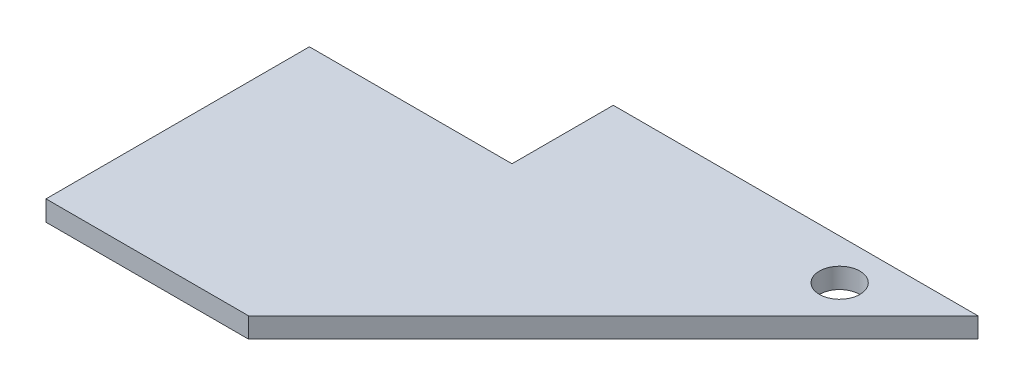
ISO-10303-21;
HEADER;
FILE_DESCRIPTION(('STEP AP214'),'2;1');
FILE_NAME('part.step','',(''),(''),'','','');
FILE_SCHEMA(('AUTOMOTIVE_DESIGN { 1 0 10303 214 1 1 1 1 }'));
ENDSEC;
DATA;
#1=APPLICATION_CONTEXT('core data for automotive mechanical design processes');
#2=APPLICATION_PROTOCOL_DEFINITION('international standard','automotive_design',2000,#1);
#3=PRODUCT_CONTEXT('',#1,'mechanical');
#4=PRODUCT('Part','Part','',(#3));
#5=PRODUCT_RELATED_PRODUCT_CATEGORY('part','',(#4));
#6=PRODUCT_DEFINITION_FORMATION('','',#4);
#7=PRODUCT_DEFINITION_CONTEXT('part definition',#1,'design');
#8=PRODUCT_DEFINITION('design','',#6,#7);
#9=PRODUCT_DEFINITION_SHAPE('','',#8);
#10=(LENGTH_UNIT() NAMED_UNIT(*) SI_UNIT(.MILLI.,.METRE.));
#11=(NAMED_UNIT(*) PLANE_ANGLE_UNIT() SI_UNIT($,.RADIAN.));
#12=(NAMED_UNIT(*) SI_UNIT($,.STERADIAN.) SOLID_ANGLE_UNIT());
#13=UNCERTAINTY_MEASURE_WITH_UNIT(LENGTH_MEASURE(1.E-05),#10,'distance_accuracy_value','');
#14=(GEOMETRIC_REPRESENTATION_CONTEXT(3) GLOBAL_UNCERTAINTY_ASSIGNED_CONTEXT((#13)) GLOBAL_UNIT_ASSIGNED_CONTEXT((#10,
#11,#12)) REPRESENTATION_CONTEXT('',''));
#15=CARTESIAN_POINT('',(0.,0.,0.));
#16=DIRECTION('',(0.,0.,1.));
#17=DIRECTION('',(1.,0.,0.));
#18=AXIS2_PLACEMENT_3D('',#15,#16,#17);
#19=CARTESIAN_POINT('',(0.,5.,-65.));
#20=DIRECTION('',(1.,0.,0.));
#21=DIRECTION('',(0.,0.,-1.));
#22=AXIS2_PLACEMENT_3D('',#19,#20,#21);
#23=PLANE('',#22);
#24=DIRECTION('',(0.,0.,1.));
#25=VECTOR('',#24,1.);
#26=CARTESIAN_POINT('',(0.,0.,-65.));
#27=LINE('',#26,#25);
#28=CARTESIAN_POINT('',(0.,0.,-65.));
#29=VERTEX_POINT('',#28);
#30=CARTESIAN_POINT('',(0.,0.,0.));
#31=VERTEX_POINT('',#30);
#32=EDGE_CURVE('E89',#29,#31,#27,.T.);
#33=ORIENTED_EDGE('',*,*,#32,.T.);
#34=DIRECTION('',(0.,-1.,0.));
#35=VECTOR('',#34,1.);
#36=CARTESIAN_POINT('',(0.,5.,0.));
#37=LINE('',#36,#35);
#38=CARTESIAN_POINT('',(0.,5.,0.));
#39=VERTEX_POINT('',#38);
#40=EDGE_CURVE('E11',#39,#31,#37,.T.);
#41=ORIENTED_EDGE('',*,*,#40,.F.);
#42=DIRECTION('',(0.,0.,1.));
#43=VECTOR('',#42,1.);
#44=CARTESIAN_POINT('',(0.,5.,-65.));
#45=LINE('',#44,#43);
#46=CARTESIAN_POINT('',(0.,5.,-65.));
#47=VERTEX_POINT('',#46);
#48=EDGE_CURVE('E117',#47,#39,#45,.T.);
#49=ORIENTED_EDGE('',*,*,#48,.F.);
#50=DIRECTION('',(0.,-1.,0.));
#51=VECTOR('',#50,1.);
#52=CARTESIAN_POINT('',(0.,5.,-65.));
#53=LINE('',#52,#51);
#54=EDGE_CURVE('E102',#47,#29,#53,.T.);
#55=ORIENTED_EDGE('',*,*,#54,.T.);
#56=EDGE_LOOP('',(#33,#41,#49,#55));
#57=FACE_BOUND('',#56,.T.);
#58=ADVANCED_FACE('F33',(#57),#23,.F.);
#59=CARTESIAN_POINT('',(0.,5.,0.));
#60=DIRECTION('',(0.,0.,-1.));
#61=DIRECTION('',(-1.,0.,0.));
#62=AXIS2_PLACEMENT_3D('',#59,#60,#61);
#63=PLANE('',#62);
#64=DIRECTION('',(1.,0.,0.));
#65=VECTOR('',#64,1.);
#66=CARTESIAN_POINT('',(0.,0.,0.));
#67=LINE('',#66,#65);
#68=CARTESIAN_POINT('',(50.,0.,0.));
#69=VERTEX_POINT('',#68);
#70=EDGE_CURVE('E85',#31,#69,#67,.T.);
#71=ORIENTED_EDGE('',*,*,#70,.T.);
#72=DIRECTION('',(0.,-1.,0.));
#73=VECTOR('',#72,1.);
#74=CARTESIAN_POINT('',(50.,5.,0.));
#75=LINE('',#74,#73);
#76=CARTESIAN_POINT('',(50.,5.,0.));
#77=VERTEX_POINT('',#76);
#78=EDGE_CURVE('E40',#77,#69,#75,.T.);
#79=ORIENTED_EDGE('',*,*,#78,.F.);
#80=DIRECTION('',(1.,0.,0.));
#81=VECTOR('',#80,1.);
#82=CARTESIAN_POINT('',(0.,5.,0.));
#83=LINE('',#82,#81);
#84=EDGE_CURVE('E98',#39,#77,#83,.T.);
#85=ORIENTED_EDGE('',*,*,#84,.F.);
#86=ORIENTED_EDGE('',*,*,#40,.T.);
#87=EDGE_LOOP('',(#71,#79,#85,#86));
#88=FACE_BOUND('',#87,.T.);
#89=ADVANCED_FACE('F97',(#88),#63,.F.);
#90=CARTESIAN_POINT('',(50.,5.,0.));
#91=DIRECTION('',(-0.707106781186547,0.,-0.707106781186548));
#92=DIRECTION('',(-0.707106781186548,0.,0.707106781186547));
#93=AXIS2_PLACEMENT_3D('',#90,#91,#92);
#94=PLANE('',#93);
#95=DIRECTION('',(0.707106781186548,0.,-0.707106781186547));
#96=VECTOR('',#95,1.);
#97=CARTESIAN_POINT('',(50.,0.,0.));
#98=LINE('',#97,#96);
#99=CARTESIAN_POINT('',(140.,0.,-89.9999999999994));
#100=VERTEX_POINT('',#99);
#101=EDGE_CURVE('E91',#69,#100,#98,.T.);
#102=ORIENTED_EDGE('',*,*,#101,.T.);
#103=DIRECTION('',(0.,-1.,0.));
#104=VECTOR('',#103,1.);
#105=CARTESIAN_POINT('',(140.,5.,-89.9999999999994));
#106=LINE('',#105,#104);
#107=CARTESIAN_POINT('',(140.,5.,-89.9999999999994));
#108=VERTEX_POINT('',#107);
#109=EDGE_CURVE('E133',#108,#100,#106,.T.);
#110=ORIENTED_EDGE('',*,*,#109,.F.);
#111=DIRECTION('',(0.707106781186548,0.,-0.707106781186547));
#112=VECTOR('',#111,1.);
#113=CARTESIAN_POINT('',(50.,5.,0.));
#114=LINE('',#113,#112);
#115=EDGE_CURVE('E120',#77,#108,#114,.T.);
#116=ORIENTED_EDGE('',*,*,#115,.F.);
#117=ORIENTED_EDGE('',*,*,#78,.T.);
#118=EDGE_LOOP('',(#102,#110,#116,#117));
#119=FACE_BOUND('',#118,.T.);
#120=ADVANCED_FACE('F137',(#119),#94,.F.);
#121=CARTESIAN_POINT('',(140.,5.,-89.9999999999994));
#122=DIRECTION('',(0.,0.,1.));
#123=DIRECTION('',(1.,0.,0.));
#124=AXIS2_PLACEMENT_3D('',#121,#122,#123);
#125=PLANE('',#124);
#126=DIRECTION('',(-1.,0.,0.));
#127=VECTOR('',#126,1.);
#128=CARTESIAN_POINT('',(140.,0.,-89.9999999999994));
#129=LINE('',#128,#127);
#130=CARTESIAN_POINT('',(49.9999999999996,0.,-89.9999999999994));
#131=VERTEX_POINT('',#130);
#132=EDGE_CURVE('E111',#100,#131,#129,.T.);
#133=ORIENTED_EDGE('',*,*,#132,.T.);
#134=DIRECTION('',(0.,-1.,0.));
#135=VECTOR('',#134,1.);
#136=CARTESIAN_POINT('',(49.9999999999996,5.,-89.9999999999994));
#137=LINE('',#136,#135);
#138=CARTESIAN_POINT('',(49.9999999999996,5.,-89.9999999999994));
#139=VERTEX_POINT('',#138);
#140=EDGE_CURVE('E130',#139,#131,#137,.T.);
#141=ORIENTED_EDGE('',*,*,#140,.F.);
#142=DIRECTION('',(-1.,0.,0.));
#143=VECTOR('',#142,1.);
#144=CARTESIAN_POINT('',(140.,5.,-89.9999999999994));
#145=LINE('',#144,#143);
#146=EDGE_CURVE('E122',#108,#139,#145,.T.);
#147=ORIENTED_EDGE('',*,*,#146,.F.);
#148=ORIENTED_EDGE('',*,*,#109,.T.);
#149=EDGE_LOOP('',(#133,#141,#147,#148));
#150=FACE_BOUND('',#149,.T.);
#151=ADVANCED_FACE('F143',(#150),#125,.F.);
#152=CARTESIAN_POINT('',(49.9999999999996,5.,-89.9999999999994));
#153=DIRECTION('',(1.,0.,0.));
#154=DIRECTION('',(0.,0.,-1.));
#155=AXIS2_PLACEMENT_3D('',#152,#153,#154);
#156=PLANE('',#155);
#157=DIRECTION('',(0.,0.,1.));
#158=VECTOR('',#157,1.);
#159=CARTESIAN_POINT('',(49.9999999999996,0.,-89.9999999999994));
#160=LINE('',#159,#158);
#161=CARTESIAN_POINT('',(50.,0.,-65.));
#162=VERTEX_POINT('',#161);
#163=EDGE_CURVE('E113',#131,#162,#160,.T.);
#164=ORIENTED_EDGE('',*,*,#163,.T.);
#165=DIRECTION('',(0.,-1.,0.));
#166=VECTOR('',#165,1.);
#167=CARTESIAN_POINT('',(50.,5.,-65.));
#168=LINE('',#167,#166);
#169=CARTESIAN_POINT('',(50.,5.,-65.));
#170=VERTEX_POINT('',#169);
#171=EDGE_CURVE('E127',#170,#162,#168,.T.);
#172=ORIENTED_EDGE('',*,*,#171,.F.);
#173=DIRECTION('',(0.,0.,1.));
#174=VECTOR('',#173,1.);
#175=CARTESIAN_POINT('',(49.9999999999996,5.,-89.9999999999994));
#176=LINE('',#175,#174);
#177=EDGE_CURVE('E52',#139,#170,#176,.T.);
#178=ORIENTED_EDGE('',*,*,#177,.F.);
#179=ORIENTED_EDGE('',*,*,#140,.T.);
#180=EDGE_LOOP('',(#164,#172,#178,#179));
#181=FACE_BOUND('',#180,.T.);
#182=ADVANCED_FACE('F146',(#181),#156,.F.);
#183=CARTESIAN_POINT('',(50.,5.,-65.));
#184=DIRECTION('',(0.,0.,1.));
#185=DIRECTION('',(1.,0.,0.));
#186=AXIS2_PLACEMENT_3D('',#183,#184,#185);
#187=PLANE('',#186);
#188=DIRECTION('',(-1.,0.,0.));
#189=VECTOR('',#188,1.);
#190=CARTESIAN_POINT('',(50.,0.,-65.));
#191=LINE('',#190,#189);
#192=EDGE_CURVE('E115',#162,#29,#191,.T.);
#193=ORIENTED_EDGE('',*,*,#192,.T.);
#194=ORIENTED_EDGE('',*,*,#54,.F.);
#195=DIRECTION('',(-1.,0.,0.));
#196=VECTOR('',#195,1.);
#197=CARTESIAN_POINT('',(50.,5.,-65.));
#198=LINE('',#197,#196);
#199=EDGE_CURVE('E47',#170,#47,#198,.T.);
#200=ORIENTED_EDGE('',*,*,#199,.F.);
#201=ORIENTED_EDGE('',*,*,#171,.T.);
#202=EDGE_LOOP('',(#193,#194,#200,#201));
#203=FACE_BOUND('',#202,.T.);
#204=ADVANCED_FACE('F148',(#203),#187,.F.);
#205=CARTESIAN_POINT('',(0.,5.,0.));
#206=DIRECTION('',(0.,1.,0.));
#207=DIRECTION('',(0.,0.,1.));
#208=AXIS2_PLACEMENT_3D('',#205,#206,#207);
#209=PLANE('',#208);
#210=CARTESIAN_POINT('',(115.857864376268,5.,-79.9999999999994));
#211=DIRECTION('',(0.,1.,0.));
#212=DIRECTION('',(0.,0.,1.));
#213=AXIS2_PLACEMENT_3D('',#210,#211,#212);
#214=CIRCLE('',#213,5.00000000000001);
#215=CARTESIAN_POINT('',(115.857864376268,5.,-74.9999999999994));
#216=VERTEX_POINT('',#215);
#217=EDGE_CURVE('E106',#216,#216,#214,.T.);
#218=ORIENTED_EDGE('',*,*,#217,.F.);
#219=EDGE_LOOP('',(#218));
#220=FACE_BOUND('',#219,.T.);
#221=ORIENTED_EDGE('',*,*,#48,.T.);
#222=ORIENTED_EDGE('',*,*,#84,.T.);
#223=ORIENTED_EDGE('',*,*,#115,.T.);
#224=ORIENTED_EDGE('',*,*,#146,.T.);
#225=ORIENTED_EDGE('',*,*,#177,.T.);
#226=ORIENTED_EDGE('',*,*,#199,.T.);
#227=EDGE_LOOP('',(#221,#222,#223,#224,#225,#226));
#228=FACE_BOUND('',#227,.T.);
#229=ADVANCED_FACE('F140',(#220,#228),#209,.T.);
#230=CARTESIAN_POINT('',(0.,0.,0.));
#231=DIRECTION('',(0.,1.,0.));
#232=DIRECTION('',(0.,0.,1.));
#233=AXIS2_PLACEMENT_3D('',#230,#231,#232);
#234=PLANE('',#233);
#235=CARTESIAN_POINT('',(115.857864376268,0.,-79.9999999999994));
#236=DIRECTION('',(0.,1.,0.));
#237=DIRECTION('',(0.,0.,1.));
#238=AXIS2_PLACEMENT_3D('',#235,#236,#237);
#239=CIRCLE('',#238,5.00000000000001);
#240=CARTESIAN_POINT('',(115.857864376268,0.,-74.9999999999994));
#241=VERTEX_POINT('',#240);
#242=EDGE_CURVE('E103',#241,#241,#239,.T.);
#243=ORIENTED_EDGE('',*,*,#242,.T.);
#244=EDGE_LOOP('',(#243));
#245=FACE_BOUND('',#244,.T.);
#246=ORIENTED_EDGE('',*,*,#32,.F.);
#247=ORIENTED_EDGE('',*,*,#192,.F.);
#248=ORIENTED_EDGE('',*,*,#163,.F.);
#249=ORIENTED_EDGE('',*,*,#132,.F.);
#250=ORIENTED_EDGE('',*,*,#101,.F.);
#251=ORIENTED_EDGE('',*,*,#70,.F.);
#252=EDGE_LOOP('',(#246,#247,#248,#249,#250,#251));
#253=FACE_BOUND('',#252,.T.);
#254=ADVANCED_FACE('F86',(#245,#253),#234,.F.);
#255=CARTESIAN_POINT('',(115.857864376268,0.,-79.9999999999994));
#256=DIRECTION('',(0.,1.,0.));
#257=DIRECTION('',(0.,0.,1.));
#258=AXIS2_PLACEMENT_3D('',#255,#256,#257);
#259=CYLINDRICAL_SURFACE('',#258,5.00000000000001);
#260=ORIENTED_EDGE('',*,*,#242,.F.);
#261=EDGE_LOOP('',(#260));
#262=FACE_BOUND('',#261,.T.);
#263=ORIENTED_EDGE('',*,*,#217,.T.);
#264=EDGE_LOOP('',(#263));
#265=FACE_BOUND('',#264,.T.);
#266=ADVANCED_FACE('F195',(#262,#265),#259,.F.);
#267=CLOSED_SHELL('',(#58,#89,#120,#151,#182,#204,#229,#254,#266));
#268=MANIFOLD_SOLID_BREP('B2',#267);
#269=ADVANCED_BREP_SHAPE_REPRESENTATION('',(#18,#268),#14);
#270=SHAPE_DEFINITION_REPRESENTATION(#9,#269);
ENDSEC;
END-ISO-10303-21;
